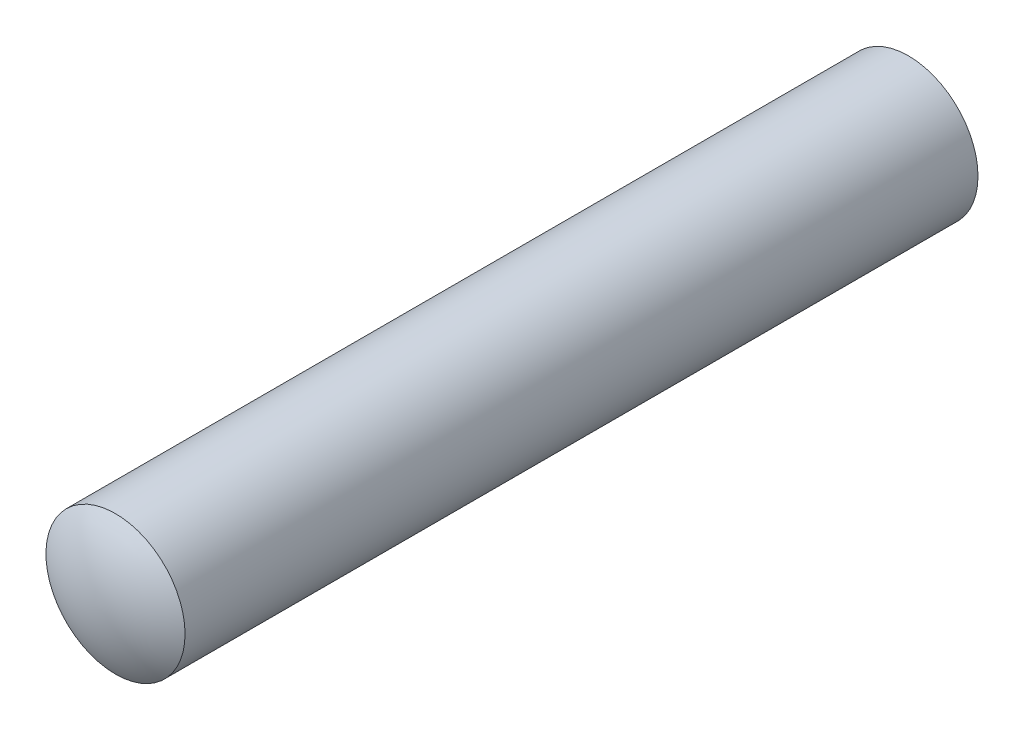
ISO-10303-21;
HEADER;
FILE_DESCRIPTION(('STEP AP214'),'2;1');
FILE_NAME('part.step','',(''),(''),'','','');
FILE_SCHEMA(('AUTOMOTIVE_DESIGN { 1 0 10303 214 1 1 1 1 }'));
ENDSEC;
DATA;
#1=APPLICATION_CONTEXT('core data for automotive mechanical design processes');
#2=APPLICATION_PROTOCOL_DEFINITION('international standard','automotive_design',2000,#1);
#3=PRODUCT_CONTEXT('',#1,'mechanical');
#4=PRODUCT('Part','Part','',(#3));
#5=PRODUCT_RELATED_PRODUCT_CATEGORY('part','',(#4));
#6=PRODUCT_DEFINITION_FORMATION('','',#4);
#7=PRODUCT_DEFINITION_CONTEXT('part definition',#1,'design');
#8=PRODUCT_DEFINITION('design','',#6,#7);
#9=PRODUCT_DEFINITION_SHAPE('','',#8);
#10=(LENGTH_UNIT() NAMED_UNIT(*) SI_UNIT(.MILLI.,.METRE.));
#11=(NAMED_UNIT(*) PLANE_ANGLE_UNIT() SI_UNIT($,.RADIAN.));
#12=(NAMED_UNIT(*) SI_UNIT($,.STERADIAN.) SOLID_ANGLE_UNIT());
#13=UNCERTAINTY_MEASURE_WITH_UNIT(LENGTH_MEASURE(1.E-05),#10,'distance_accuracy_value','');
#14=(GEOMETRIC_REPRESENTATION_CONTEXT(3) GLOBAL_UNCERTAINTY_ASSIGNED_CONTEXT((#13)) GLOBAL_UNIT_ASSIGNED_CONTEXT((#10,
#11,#12)) REPRESENTATION_CONTEXT('',''));
#15=CARTESIAN_POINT('',(0.,0.,0.));
#16=DIRECTION('',(0.,0.,1.));
#17=DIRECTION('',(1.,0.,0.));
#18=AXIS2_PLACEMENT_3D('',#15,#16,#17);
#19=CARTESIAN_POINT('',(0.,0.,-1.81666666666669));
#20=DIRECTION('',(0.,0.,1.));
#21=DIRECTION('',(0.,-1.,0.));
#22=AXIS2_PLACEMENT_3D('',#19,#20,#21);
#23=SPHERICAL_SURFACE('',#22,1.81666666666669);
#24=CARTESIAN_POINT('',(0.,0.,-0.3));
#25=DIRECTION('',(0.,0.,1.));
#26=DIRECTION('',(1.,0.,0.));
#27=AXIS2_PLACEMENT_3D('',#24,#25,#26);
#28=CIRCLE('',#27,1.00000000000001);
#29=CARTESIAN_POINT('',(1.00000000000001,0.,-0.3));
#30=VERTEX_POINT('',#29);
#31=EDGE_CURVE('E10',#30,#30,#28,.T.);
#32=ORIENTED_EDGE('',*,*,#31,.T.);
#33=EDGE_LOOP('',(#32));
#34=FACE_BOUND('',#33,.T.);
#35=ADVANCED_FACE('F30',(#34),#23,.T.);
#36=CARTESIAN_POINT('',(0.,0.,10.7228972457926));
#37=DIRECTION('',(0.,0.,1.));
#38=DIRECTION('',(1.,0.,0.));
#39=AXIS2_PLACEMENT_3D('',#36,#37,#38);
#40=CYLINDRICAL_SURFACE('',#39,1.);
#41=ORIENTED_EDGE('',*,*,#31,.F.);
#42=EDGE_LOOP('',(#41));
#43=FACE_BOUND('',#42,.T.);
#44=CARTESIAN_POINT('',(0.,0.,-11.7));
#45=DIRECTION('',(0.,0.,1.));
#46=DIRECTION('',(1.,0.,0.));
#47=AXIS2_PLACEMENT_3D('',#44,#45,#46);
#48=CIRCLE('',#47,1.);
#49=CARTESIAN_POINT('',(1.,0.,-11.7));
#50=VERTEX_POINT('',#49);
#51=EDGE_CURVE('E36',#50,#50,#48,.T.);
#52=ORIENTED_EDGE('',*,*,#51,.T.);
#53=EDGE_LOOP('',(#52));
#54=FACE_BOUND('',#53,.T.);
#55=ADVANCED_FACE('F42',(#43,#54),#40,.T.);
#56=CARTESIAN_POINT('',(0.,0.,-10.1833333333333));
#57=DIRECTION('',(0.,0.,1.));
#58=DIRECTION('',(0.,1.,0.));
#59=AXIS2_PLACEMENT_3D('',#56,#57,#58);
#60=SPHERICAL_SURFACE('',#59,1.81666666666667);
#61=ORIENTED_EDGE('',*,*,#51,.F.);
#62=EDGE_LOOP('',(#61));
#63=FACE_BOUND('',#62,.T.);
#64=ADVANCED_FACE('F44',(#63),#60,.T.);
#65=CLOSED_SHELL('',(#35,#55,#64));
#66=MANIFOLD_SOLID_BREP('B2',#65);
#67=ADVANCED_BREP_SHAPE_REPRESENTATION('',(#18,#66),#14);
#68=SHAPE_DEFINITION_REPRESENTATION(#9,#67);
ENDSEC;
END-ISO-10303-21;
